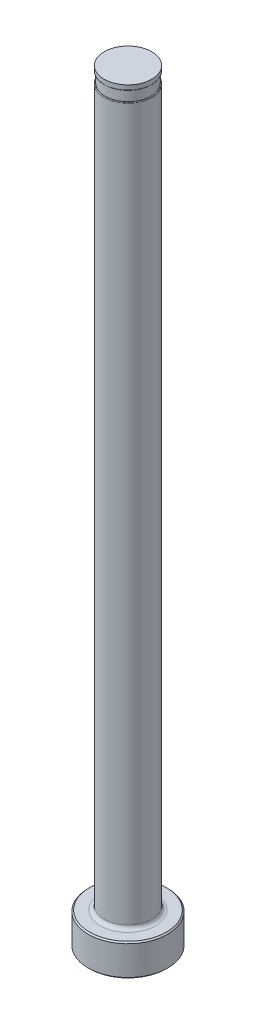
from build123d import *

# Parameters (mm, degrees)
CHAMFER1_SIZE     = 0.254
FILLET1_R         = 0.762
SKETCH2_W         = 0.2032
SKETCH2_H         = 2.032
D_SLOT_DEPTH      = 153.812852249
D_SLOT_DEPTH_BACK = 153.812852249
SKETCH5_W         = 0.00508
SKETCH5_H         = 1.016
FILLET2_R         = 0.127


with BuildPart() as part:
    # Sketch1 → Revolve1 (revolve)
    with BuildSketch(Plane.XY, mode=Mode.PRIVATE) as revolve1_sk:
        Polygon((0, 0), (-7.9375, 0), (-7.9375, 6.35), (-4.7625, 6.35), (-4.7625, 152.4), (0, 152.4), align=None)
    revolve(revolve1_sk.sketch.rotate(Axis((0, 259.958771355, 0), (0, -1, 0)), 270), axis=Axis((0, 259.958771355, 0), (0, -1, 0)))

    # Chamfer1
    chamfer1_edges = [part.edges().sort_by_distance(p)[0] for p in [
        (0, 6.35, -7.9375),
        (0, 0, -7.9375),
    ]]
    chamfer(chamfer1_edges, length=CHAMFER1_SIZE)

    # Fillet1
    fillet1_edges = [part.edges().sort_by_distance(p)[0] for p in [
        (0, 6.35, -4.7625),
    ]]
    fillet(fillet1_edges, radius=FILLET1_R)

    # Sketch2 → Vent Relief (revolve, cut)
    with BuildSketch(Plane.XY, mode=Mode.PRIVATE) as vent_relief_sk:
        with Locations((-4.6609, 150.368)):
            Rectangle(SKETCH2_W, SKETCH2_H)
    revolve(vent_relief_sk.sketch.rotate(Axis((0, 153.448281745, 0), (0, -1, 0)), 270), axis=Axis((0, 153.448281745, 0), (0, -1, 0)), mode=Mode.SUBTRACT)

    # Sketch3 → D-Slot (cut, two sides: drawn at the far end of the back side and taken through both)
    with BuildSketch(Plane.XY.offset(-D_SLOT_DEPTH_BACK)):
        with BuildLine():
            Line((-4.5593, 150.368), (-4.5593, 86.868))
            ThreePointArc((-4.5593, 86.868), (-4.610513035, 86.300038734), (-4.7625, 85.7504))
            Line((-4.7625, 85.7504), (-4.7625, 150.368))
            Line((-4.7625, 150.368), (-4.5593, 150.368))
        make_face()
    extrude(amount=D_SLOT_DEPTH + D_SLOT_DEPTH_BACK, mode=Mode.SUBTRACT)

    # Sketch5 → Vent Diameter (revolve, cut)
    with BuildSketch(Plane.XY, mode=Mode.PRIVATE) as vent_diameter_sk:
        with Locations((-4.75996, 151.892)):
            Rectangle(SKETCH5_W, SKETCH5_H)
    revolve(vent_diameter_sk.sketch.rotate(Axis((0, 152.687735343, 0), (0, -1, 0)), 90), axis=Axis((0, 152.687735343, 0), (0, -1, 0)), mode=Mode.SUBTRACT)

    # Fillet2
    fillet2_edges = [part.edges().sort_by_distance(p)[0] for p in [
        (3.823350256, 149.352, -2.839612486),
        (0, 151.384, 4.75742),
    ]]
    fillet(fillet2_edges, radius=FILLET2_R)


solid = part.part
